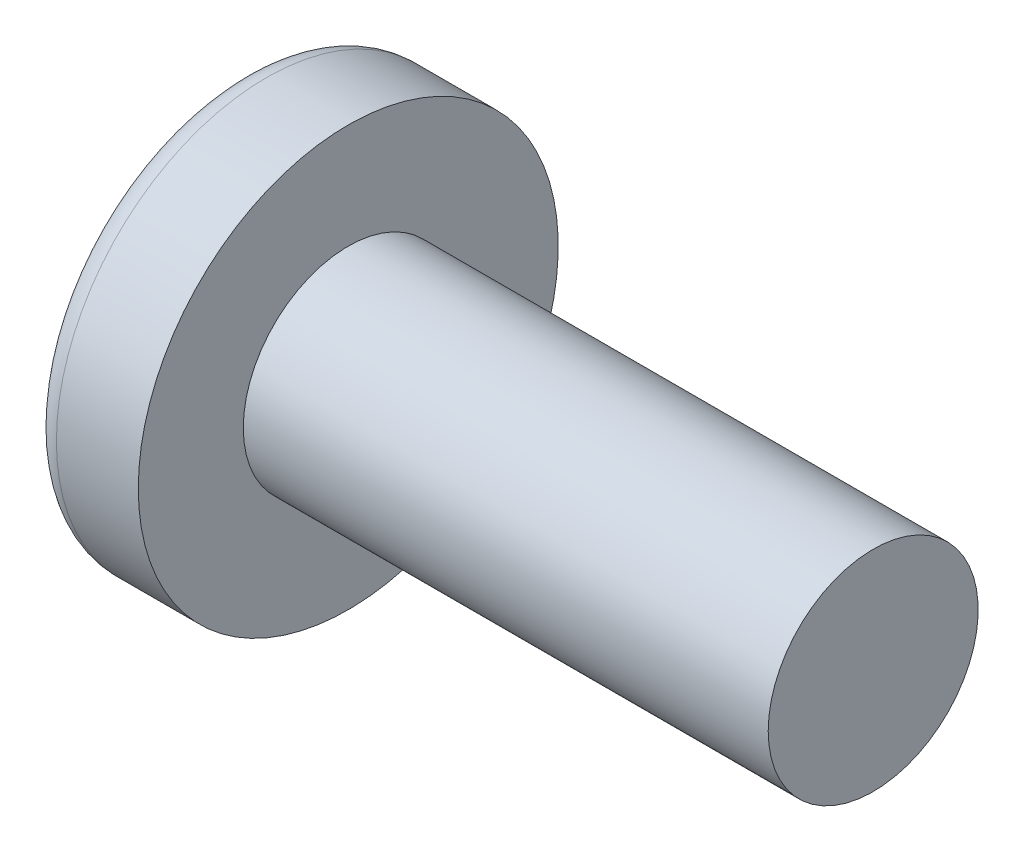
ISO-10303-21;
HEADER;
FILE_DESCRIPTION(('STEP AP214'),'2;1');
FILE_NAME('part.step','',(''),(''),'','','');
FILE_SCHEMA(('AUTOMOTIVE_DESIGN { 1 0 10303 214 1 1 1 1 }'));
ENDSEC;
DATA;
#1=APPLICATION_CONTEXT('core data for automotive mechanical design processes');
#2=APPLICATION_PROTOCOL_DEFINITION('international standard','automotive_design',2000,#1);
#3=PRODUCT_CONTEXT('',#1,'mechanical');
#4=PRODUCT('Part','Part','',(#3));
#5=PRODUCT_RELATED_PRODUCT_CATEGORY('part','',(#4));
#6=PRODUCT_DEFINITION_FORMATION('','',#4);
#7=PRODUCT_DEFINITION_CONTEXT('part definition',#1,'design');
#8=PRODUCT_DEFINITION('design','',#6,#7);
#9=PRODUCT_DEFINITION_SHAPE('','',#8);
#10=(LENGTH_UNIT() NAMED_UNIT(*) SI_UNIT(.MILLI.,.METRE.));
#11=(NAMED_UNIT(*) PLANE_ANGLE_UNIT() SI_UNIT($,.RADIAN.));
#12=(NAMED_UNIT(*) SI_UNIT($,.STERADIAN.) SOLID_ANGLE_UNIT());
#13=UNCERTAINTY_MEASURE_WITH_UNIT(LENGTH_MEASURE(1.E-05),#10,'distance_accuracy_value','');
#14=(GEOMETRIC_REPRESENTATION_CONTEXT(3) GLOBAL_UNCERTAINTY_ASSIGNED_CONTEXT((#13)) GLOBAL_UNIT_ASSIGNED_CONTEXT((#10,
#11,#12)) REPRESENTATION_CONTEXT('',''));
#15=CARTESIAN_POINT('',(0.,0.,0.));
#16=DIRECTION('',(0.,0.,1.));
#17=DIRECTION('',(1.,0.,0.));
#18=AXIS2_PLACEMENT_3D('',#15,#16,#17);
#19=CARTESIAN_POINT('',(3.2,0.,0.));
#20=DIRECTION('',(-1.,0.,0.));
#21=DIRECTION('',(0.,1.,0.));
#22=AXIS2_PLACEMENT_3D('',#19,#20,#21);
#23=SPHERICAL_SURFACE('',#22,3.2);
#24=CARTESIAN_POINT('',(0.627117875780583,0.,0.));
#25=DIRECTION('',(-1.,0.,0.));
#26=DIRECTION('',(0.,0.,1.));
#27=AXIS2_PLACEMENT_3D('',#24,#25,#26);
#28=CIRCLE('',#27,1.9027027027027);
#29=CARTESIAN_POINT('',(0.627117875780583,0.,1.9027027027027));
#30=VERTEX_POINT('',#29);
#31=EDGE_CURVE('E177',#30,#30,#28,.T.);
#32=ORIENTED_EDGE('',*,*,#31,.T.);
#33=EDGE_LOOP('',(#32));
#34=FACE_BOUND('',#33,.T.);
#35=CARTESIAN_POINT('',(3.19174554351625,-0.0818566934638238,0.));
#36=DIRECTION('',(-0.100331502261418,-0.994954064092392,0.));
#37=DIRECTION('',(0.994954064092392,-0.100331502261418,0.));
#38=AXIS2_PLACEMENT_3D('',#35,#36,#37);
#39=CIRCLE('',#38,3.1989422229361);
#40=CARTESIAN_POINT('',(0.118330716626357,0.228067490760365,0.83144431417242));
#41=VERTEX_POINT('',#40);
#42=CARTESIAN_POINT('',(0.0177814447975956,0.238206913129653,0.238206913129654));
#43=VERTEX_POINT('',#42);
#44=EDGE_CURVE('E228',#41,#43,#39,.T.);
#45=ORIENTED_EDGE('',*,*,#44,.F.);
#46=CARTESIAN_POINT('',(2.64043280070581,0.,-0.842892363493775));
#47=DIRECTION('',(0.553083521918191,0.,0.833125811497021));
#48=DIRECTION('',(0.833125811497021,0.,-0.553083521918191));
#49=AXIS2_PLACEMENT_3D('',#46,#47,#48);
#50=CIRCLE('',#49,3.03585523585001);
#51=CARTESIAN_POINT('',(0.118330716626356,-0.22806749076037,0.831444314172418));
#52=VERTEX_POINT('',#51);
#53=EDGE_CURVE('E176',#41,#52,#50,.T.);
#54=ORIENTED_EDGE('',*,*,#53,.T.);
#55=CARTESIAN_POINT('',(3.19174554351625,0.0818566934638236,0.));
#56=DIRECTION('',(-0.100331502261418,0.994954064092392,0.));
#57=DIRECTION('',(-0.994954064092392,-0.100331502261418,0.));
#58=AXIS2_PLACEMENT_3D('',#55,#56,#57);
#59=CIRCLE('',#58,3.1989422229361);
#60=CARTESIAN_POINT('',(0.0177814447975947,-0.238206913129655,0.238206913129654));
#61=VERTEX_POINT('',#60);
#62=EDGE_CURVE('E123',#61,#52,#59,.T.);
#63=ORIENTED_EDGE('',*,*,#62,.F.);
#64=CARTESIAN_POINT('',(3.19174554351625,0.,-0.0818566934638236));
#65=DIRECTION('',(-0.100331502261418,0.,-0.994954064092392));
#66=DIRECTION('',(-0.994954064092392,0.,0.100331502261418));
#67=AXIS2_PLACEMENT_3D('',#64,#65,#66);
#68=CIRCLE('',#67,3.1989422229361);
#69=CARTESIAN_POINT('',(0.118330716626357,-0.831444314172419,0.228067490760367));
#70=VERTEX_POINT('',#69);
#71=EDGE_CURVE('E150',#70,#61,#68,.T.);
#72=ORIENTED_EDGE('',*,*,#71,.F.);
#73=CARTESIAN_POINT('',(2.64043280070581,0.842892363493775,0.));
#74=DIRECTION('',(0.553083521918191,-0.833125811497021,0.));
#75=DIRECTION('',(0.833125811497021,0.553083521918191,0.));
#76=AXIS2_PLACEMENT_3D('',#73,#74,#75);
#77=CIRCLE('',#76,3.03585523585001);
#78=CARTESIAN_POINT('',(0.118330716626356,-0.831444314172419,-0.228067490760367));
#79=VERTEX_POINT('',#78);
#80=EDGE_CURVE('E159',#70,#79,#77,.T.);
#81=ORIENTED_EDGE('',*,*,#80,.T.);
#82=CARTESIAN_POINT('',(3.19174554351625,0.,0.0818566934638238));
#83=DIRECTION('',(-0.100331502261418,0.,0.994954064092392));
#84=DIRECTION('',(0.994954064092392,0.,0.100331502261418));
#85=AXIS2_PLACEMENT_3D('',#82,#83,#84);
#86=CIRCLE('',#85,3.1989422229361);
#87=CARTESIAN_POINT('',(0.0177814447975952,-0.238206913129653,-0.238206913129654));
#88=VERTEX_POINT('',#87);
#89=EDGE_CURVE('E66',#88,#79,#86,.T.);
#90=ORIENTED_EDGE('',*,*,#89,.F.);
#91=CARTESIAN_POINT('',(0.118330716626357,-0.228067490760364,-0.83144431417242));
#92=VERTEX_POINT('',#91);
#93=EDGE_CURVE('E229',#92,#88,#59,.T.);
#94=ORIENTED_EDGE('',*,*,#93,.F.);
#95=CARTESIAN_POINT('',(2.64043280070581,0.,0.842892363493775));
#96=DIRECTION('',(0.553083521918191,0.,-0.833125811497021));
#97=DIRECTION('',(-0.833125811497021,0.,-0.553083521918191));
#98=AXIS2_PLACEMENT_3D('',#95,#96,#97);
#99=CIRCLE('',#98,3.03585523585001);
#100=CARTESIAN_POINT('',(0.118330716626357,0.22806749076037,-0.831444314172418));
#101=VERTEX_POINT('',#100);
#102=EDGE_CURVE('E152',#92,#101,#99,.T.);
#103=ORIENTED_EDGE('',*,*,#102,.T.);
#104=CARTESIAN_POINT('',(0.0177814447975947,0.238206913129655,-0.238206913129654));
#105=VERTEX_POINT('',#104);
#106=EDGE_CURVE('E214',#105,#101,#39,.T.);
#107=ORIENTED_EDGE('',*,*,#106,.F.);
#108=CARTESIAN_POINT('',(0.118330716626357,0.831444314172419,-0.228067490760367));
#109=VERTEX_POINT('',#108);
#110=EDGE_CURVE('E59',#109,#105,#86,.T.);
#111=ORIENTED_EDGE('',*,*,#110,.F.);
#112=CARTESIAN_POINT('',(2.64043280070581,-0.842892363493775,0.));
#113=DIRECTION('',(0.553083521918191,0.833125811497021,0.));
#114=DIRECTION('',(-0.833125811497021,0.553083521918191,0.));
#115=AXIS2_PLACEMENT_3D('',#112,#113,#114);
#116=CIRCLE('',#115,3.03585523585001);
#117=CARTESIAN_POINT('',(0.118330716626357,0.831444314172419,0.228067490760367));
#118=VERTEX_POINT('',#117);
#119=EDGE_CURVE('E12',#109,#118,#116,.T.);
#120=ORIENTED_EDGE('',*,*,#119,.T.);
#121=EDGE_CURVE('E195',#43,#118,#68,.T.);
#122=ORIENTED_EDGE('',*,*,#121,.F.);
#123=EDGE_LOOP('',(#45,#54,#63,#72,#81,#90,#94,#103,#107,#111,#120,#122));
#124=FACE_BOUND('',#123,.T.);
#125=ADVANCED_FACE('F49',(#34,#124),#23,.T.);
#126=CARTESIAN_POINT('',(1.37075949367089,0.,-0.101772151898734));
#127=DIRECTION('',(-0.100331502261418,0.,0.994954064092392));
#128=DIRECTION('',(0.994954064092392,0.,0.100331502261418));
#129=AXIS2_PLACEMENT_3D('',#126,#127,#128);
#130=PLANE('',#129);
#131=ORIENTED_EDGE('',*,*,#110,.T.);
#132=DIRECTION('',(0.989983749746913,-0.0998302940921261,0.0998302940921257));
#133=VECTOR('',#132,1.);
#134=CARTESIAN_POINT('',(1.38081767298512,0.100757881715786,-0.100757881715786));
#135=LINE('',#134,#133);
#136=CARTESIAN_POINT('',(1.19,0.12,-0.12));
#137=VERTEX_POINT('',#136);
#138=EDGE_CURVE('E259',#105,#137,#135,.T.);
#139=ORIENTED_EDGE('',*,*,#138,.T.);
#140=DIRECTION('',(0.830201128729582,-0.551141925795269,0.083717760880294));
#141=VECTOR('',#140,1.);
#142=CARTESIAN_POINT('',(0.,0.91,-0.24));
#143=LINE('',#142,#141);
#144=EDGE_CURVE('E241',#109,#137,#143,.T.);
#145=ORIENTED_EDGE('',*,*,#144,.F.);
#146=EDGE_LOOP('',(#131,#139,#145));
#147=FACE_BOUND('',#146,.T.);
#148=ADVANCED_FACE('F305',(#147),#130,.T.);
#149=DIRECTION('',(0.830201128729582,0.551141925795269,0.083717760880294));
#150=VECTOR('',#149,1.);
#151=CARTESIAN_POINT('',(0.,-0.91,-0.24));
#152=LINE('',#151,#150);
#153=CARTESIAN_POINT('',(1.19,-0.12,-0.12));
#154=VERTEX_POINT('',#153);
#155=EDGE_CURVE('E161',#79,#154,#152,.T.);
#156=ORIENTED_EDGE('',*,*,#155,.T.);
#157=DIRECTION('',(-0.989983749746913,-0.0998302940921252,-0.0998302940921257));
#158=VECTOR('',#157,1.);
#159=CARTESIAN_POINT('',(1.38081767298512,-0.100757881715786,-0.100757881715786));
#160=LINE('',#159,#158);
#161=EDGE_CURVE('E264',#154,#88,#160,.T.);
#162=ORIENTED_EDGE('',*,*,#161,.T.);
#163=ORIENTED_EDGE('',*,*,#89,.T.);
#164=EDGE_LOOP('',(#156,#162,#163));
#165=FACE_BOUND('',#164,.T.);
#166=ADVANCED_FACE('F307',(#165),#130,.T.);
#167=CARTESIAN_POINT('',(1.37075949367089,0.,0.101772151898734));
#168=DIRECTION('',(-0.100331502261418,0.,-0.994954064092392));
#169=DIRECTION('',(-0.994954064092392,0.,0.100331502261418));
#170=AXIS2_PLACEMENT_3D('',#167,#168,#169);
#171=PLANE('',#170);
#172=DIRECTION('',(0.830201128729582,-0.551141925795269,-0.083717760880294));
#173=VECTOR('',#172,1.);
#174=CARTESIAN_POINT('',(0.,0.91,0.24));
#175=LINE('',#174,#173);
#176=CARTESIAN_POINT('',(1.19,0.12,0.12));
#177=VERTEX_POINT('',#176);
#178=EDGE_CURVE('E245',#118,#177,#175,.T.);
#179=ORIENTED_EDGE('',*,*,#178,.T.);
#180=DIRECTION('',(-0.989983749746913,0.0998302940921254,0.0998302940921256));
#181=VECTOR('',#180,1.);
#182=CARTESIAN_POINT('',(1.38081767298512,0.100757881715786,0.100757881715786));
#183=LINE('',#182,#181);
#184=EDGE_CURVE('E224',#177,#43,#183,.T.);
#185=ORIENTED_EDGE('',*,*,#184,.T.);
#186=ORIENTED_EDGE('',*,*,#121,.T.);
#187=EDGE_LOOP('',(#179,#185,#186));
#188=FACE_BOUND('',#187,.T.);
#189=ADVANCED_FACE('F292',(#188),#171,.T.);
#190=ORIENTED_EDGE('',*,*,#71,.T.);
#191=DIRECTION('',(0.989983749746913,0.099830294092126,-0.0998302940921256));
#192=VECTOR('',#191,1.);
#193=CARTESIAN_POINT('',(1.38081767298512,-0.100757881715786,0.100757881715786));
#194=LINE('',#193,#192);
#195=CARTESIAN_POINT('',(1.19,-0.12,0.12));
#196=VERTEX_POINT('',#195);
#197=EDGE_CURVE('E121',#61,#196,#194,.T.);
#198=ORIENTED_EDGE('',*,*,#197,.T.);
#199=DIRECTION('',(0.830201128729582,0.551141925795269,-0.0837177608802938));
#200=VECTOR('',#199,1.);
#201=CARTESIAN_POINT('',(0.,-0.91,0.24));
#202=LINE('',#201,#200);
#203=EDGE_CURVE('E148',#70,#196,#202,.T.);
#204=ORIENTED_EDGE('',*,*,#203,.F.);
#205=EDGE_LOOP('',(#190,#198,#204));
#206=FACE_BOUND('',#205,.T.);
#207=ADVANCED_FACE('F147',(#206),#171,.T.);
#208=CARTESIAN_POINT('',(-25.4,0.,0.));
#209=DIRECTION('',(-1.,0.,0.));
#210=DIRECTION('',(0.,0.,1.));
#211=AXIS2_PLACEMENT_3D('',#208,#209,#210);
#212=CYLINDRICAL_SURFACE('',#211,1.);
#213=CARTESIAN_POINT('',(6.6,0.,0.));
#214=DIRECTION('',(-1.,0.,0.));
#215=DIRECTION('',(0.,0.,1.));
#216=AXIS2_PLACEMENT_3D('',#213,#214,#215);
#217=CIRCLE('',#216,1.);
#218=CARTESIAN_POINT('',(6.6,0.,1.));
#219=VERTEX_POINT('',#218);
#220=EDGE_CURVE('E53',#219,#219,#217,.T.);
#221=ORIENTED_EDGE('',*,*,#220,.T.);
#222=EDGE_LOOP('',(#221));
#223=FACE_BOUND('',#222,.T.);
#224=CARTESIAN_POINT('',(1.6,0.,0.));
#225=DIRECTION('',(-1.,0.,0.));
#226=DIRECTION('',(0.,0.,1.));
#227=AXIS2_PLACEMENT_3D('',#224,#225,#226);
#228=CIRCLE('',#227,1.);
#229=CARTESIAN_POINT('',(1.6,0.,1.));
#230=VERTEX_POINT('',#229);
#231=EDGE_CURVE('E189',#230,#230,#228,.T.);
#232=ORIENTED_EDGE('',*,*,#231,.F.);
#233=EDGE_LOOP('',(#232));
#234=FACE_BOUND('',#233,.T.);
#235=ADVANCED_FACE('F334',(#223,#234),#212,.T.);
#236=CARTESIAN_POINT('',(1.6,1.,0.));
#237=DIRECTION('',(-1.,0.,0.));
#238=DIRECTION('',(0.,0.,1.));
#239=AXIS2_PLACEMENT_3D('',#236,#237,#238);
#240=PLANE('',#239);
#241=CARTESIAN_POINT('',(1.6,0.,0.));
#242=DIRECTION('',(-1.,0.,0.));
#243=DIRECTION('',(0.,0.,1.));
#244=AXIS2_PLACEMENT_3D('',#241,#242,#243);
#245=CIRCLE('',#244,2.);
#246=CARTESIAN_POINT('',(1.6,0.,2.));
#247=VERTEX_POINT('',#246);
#248=EDGE_CURVE('E185',#247,#247,#245,.T.);
#249=ORIENTED_EDGE('',*,*,#248,.F.);
#250=EDGE_LOOP('',(#249));
#251=FACE_BOUND('',#250,.T.);
#252=ORIENTED_EDGE('',*,*,#231,.T.);
#253=EDGE_LOOP('',(#252));
#254=FACE_BOUND('',#253,.T.);
#255=ADVANCED_FACE('F331',(#251,#254),#240,.F.);
#256=CARTESIAN_POINT('',(-25.4,0.,0.));
#257=DIRECTION('',(-1.,0.,0.));
#258=DIRECTION('',(0.,0.,1.));
#259=AXIS2_PLACEMENT_3D('',#256,#257,#258);
#260=CYLINDRICAL_SURFACE('',#259,2.);
#261=ORIENTED_EDGE('',*,*,#248,.T.);
#262=EDGE_LOOP('',(#261));
#263=FACE_BOUND('',#262,.T.);
#264=CARTESIAN_POINT('',(0.820084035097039,0.,0.));
#265=DIRECTION('',(-1.,0.,0.));
#266=DIRECTION('',(0.,0.,1.));
#267=AXIS2_PLACEMENT_3D('',#264,#265,#266);
#268=CIRCLE('',#267,2.);
#269=CARTESIAN_POINT('',(0.820084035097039,0.,2.));
#270=VERTEX_POINT('',#269);
#271=EDGE_CURVE('E181',#270,#270,#268,.T.);
#272=ORIENTED_EDGE('',*,*,#271,.F.);
#273=EDGE_LOOP('',(#272));
#274=FACE_BOUND('',#273,.T.);
#275=ADVANCED_FACE('F327',(#263,#274),#260,.T.);
#276=CARTESIAN_POINT('',(0.820084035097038,0.,0.));
#277=DIRECTION('',(-1.,0.,0.));
#278=DIRECTION('',(0.,0.,1.));
#279=AXIS2_PLACEMENT_3D('',#276,#277,#278);
#280=TOROIDAL_SURFACE('',#279,1.76,0.24);
#281=ORIENTED_EDGE('',*,*,#271,.T.);
#282=EDGE_LOOP('',(#281));
#283=FACE_BOUND('',#282,.T.);
#284=ORIENTED_EDGE('',*,*,#31,.F.);
#285=EDGE_LOOP('',(#284));
#286=FACE_BOUND('',#285,.T.);
#287=ADVANCED_FACE('F324',(#283,#286),#280,.T.);
#288=CARTESIAN_POINT('',(6.6,1.,0.));
#289=DIRECTION('',(1.,0.,0.));
#290=DIRECTION('',(0.,0.,-1.));
#291=AXIS2_PLACEMENT_3D('',#288,#289,#290);
#292=PLANE('',#291);
#293=ORIENTED_EDGE('',*,*,#220,.F.);
#294=EDGE_LOOP('',(#293));
#295=FACE_BOUND('',#294,.T.);
#296=ADVANCED_FACE('F51',(#295),#292,.T.);
#297=CARTESIAN_POINT('',(1.19,0.12,0.12));
#298=DIRECTION('',(0.553083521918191,0.833125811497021,0.));
#299=DIRECTION('',(-0.833125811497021,0.553083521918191,0.));
#300=AXIS2_PLACEMENT_3D('',#297,#298,#299);
#301=PLANE('',#300);
#302=ORIENTED_EDGE('',*,*,#144,.T.);
#303=DIRECTION('',(0.,0.,-1.));
#304=VECTOR('',#303,1.);
#305=CARTESIAN_POINT('',(1.19,0.12,0.12));
#306=LINE('',#305,#304);
#307=EDGE_CURVE('E141',#177,#137,#306,.T.);
#308=ORIENTED_EDGE('',*,*,#307,.F.);
#309=ORIENTED_EDGE('',*,*,#178,.F.);
#310=ORIENTED_EDGE('',*,*,#119,.F.);
#311=EDGE_LOOP('',(#302,#308,#309,#310));
#312=FACE_BOUND('',#311,.T.);
#313=ADVANCED_FACE('F295',(#312),#301,.F.);
#314=CARTESIAN_POINT('',(0.,-0.91,-0.24));
#315=DIRECTION('',(0.553083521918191,-0.833125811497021,0.));
#316=DIRECTION('',(0.833125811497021,0.553083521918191,0.));
#317=AXIS2_PLACEMENT_3D('',#314,#315,#316);
#318=PLANE('',#317);
#319=ORIENTED_EDGE('',*,*,#203,.T.);
#320=DIRECTION('',(0.,0.,1.));
#321=VECTOR('',#320,1.);
#322=CARTESIAN_POINT('',(1.19,-0.12,-0.12));
#323=LINE('',#322,#321);
#324=EDGE_CURVE('E140',#154,#196,#323,.T.);
#325=ORIENTED_EDGE('',*,*,#324,.F.);
#326=ORIENTED_EDGE('',*,*,#155,.F.);
#327=ORIENTED_EDGE('',*,*,#80,.F.);
#328=EDGE_LOOP('',(#319,#325,#326,#327));
#329=FACE_BOUND('',#328,.T.);
#330=ADVANCED_FACE('F156',(#329),#318,.F.);
#331=CARTESIAN_POINT('',(1.19,0.12,-0.12));
#332=DIRECTION('',(-1.,0.,0.));
#333=DIRECTION('',(0.,0.,1.));
#334=AXIS2_PLACEMENT_3D('',#331,#332,#333);
#335=PLANE('',#334);
#336=DIRECTION('',(0.,1.,0.));
#337=VECTOR('',#336,1.);
#338=CARTESIAN_POINT('',(1.19,-0.12,-0.12));
#339=LINE('',#338,#337);
#340=EDGE_CURVE('E165',#154,#137,#339,.T.);
#341=ORIENTED_EDGE('',*,*,#340,.F.);
#342=ORIENTED_EDGE('',*,*,#324,.T.);
#343=DIRECTION('',(0.,-1.,0.));
#344=VECTOR('',#343,1.);
#345=CARTESIAN_POINT('',(1.19,0.12,0.12));
#346=LINE('',#345,#344);
#347=EDGE_CURVE('E131',#177,#196,#346,.T.);
#348=ORIENTED_EDGE('',*,*,#347,.F.);
#349=ORIENTED_EDGE('',*,*,#307,.T.);
#350=EDGE_LOOP('',(#341,#342,#348,#349));
#351=FACE_BOUND('',#350,.T.);
#352=ADVANCED_FACE('F163',(#351),#335,.T.);
#353=CARTESIAN_POINT('',(0.,0.240000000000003,-0.909999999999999));
#354=DIRECTION('',(0.553083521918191,0.,-0.833125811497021));
#355=DIRECTION('',(0.833125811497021,0.,0.553083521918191));
#356=AXIS2_PLACEMENT_3D('',#353,#354,#355);
#357=PLANE('',#356);
#358=DIRECTION('',(0.830201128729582,0.0837177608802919,0.551141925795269));
#359=VECTOR('',#358,1.);
#360=CARTESIAN_POINT('',(0.,-0.239999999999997,-0.910000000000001));
#361=LINE('',#360,#359);
#362=EDGE_CURVE('E217',#92,#154,#361,.T.);
#363=ORIENTED_EDGE('',*,*,#362,.T.);
#364=ORIENTED_EDGE('',*,*,#340,.T.);
#365=DIRECTION('',(0.830201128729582,-0.0837177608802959,0.551141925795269));
#366=VECTOR('',#365,1.);
#367=CARTESIAN_POINT('',(0.,0.240000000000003,-0.909999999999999));
#368=LINE('',#367,#366);
#369=EDGE_CURVE('E128',#101,#137,#368,.T.);
#370=ORIENTED_EDGE('',*,*,#369,.F.);
#371=ORIENTED_EDGE('',*,*,#102,.F.);
#372=EDGE_LOOP('',(#363,#364,#370,#371));
#373=FACE_BOUND('',#372,.T.);
#374=ADVANCED_FACE('F302',(#373),#357,.F.);
#375=CARTESIAN_POINT('',(1.37075949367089,-0.101772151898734,0.));
#376=DIRECTION('',(-0.100331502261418,0.994954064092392,0.));
#377=DIRECTION('',(-0.994954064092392,-0.100331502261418,0.));
#378=AXIS2_PLACEMENT_3D('',#375,#376,#377);
#379=PLANE('',#378);
#380=ORIENTED_EDGE('',*,*,#93,.T.);
#381=ORIENTED_EDGE('',*,*,#161,.F.);
#382=ORIENTED_EDGE('',*,*,#362,.F.);
#383=EDGE_LOOP('',(#380,#381,#382));
#384=FACE_BOUND('',#383,.T.);
#385=ADVANCED_FACE('F386',(#384),#379,.T.);
#386=CARTESIAN_POINT('',(1.37075949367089,0.101772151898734,0.));
#387=DIRECTION('',(-0.100331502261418,-0.994954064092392,0.));
#388=DIRECTION('',(0.994954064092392,-0.100331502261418,0.));
#389=AXIS2_PLACEMENT_3D('',#386,#387,#388);
#390=PLANE('',#389);
#391=ORIENTED_EDGE('',*,*,#106,.T.);
#392=ORIENTED_EDGE('',*,*,#369,.T.);
#393=ORIENTED_EDGE('',*,*,#138,.F.);
#394=EDGE_LOOP('',(#391,#392,#393));
#395=FACE_BOUND('',#394,.T.);
#396=ADVANCED_FACE('F300',(#395),#390,.T.);
#397=CARTESIAN_POINT('',(1.19,-0.12,0.12));
#398=DIRECTION('',(0.553083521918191,0.,0.833125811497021));
#399=DIRECTION('',(-0.833125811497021,0.,0.553083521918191));
#400=AXIS2_PLACEMENT_3D('',#397,#398,#399);
#401=PLANE('',#400);
#402=DIRECTION('',(0.830201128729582,-0.0837177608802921,-0.551141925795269));
#403=VECTOR('',#402,1.);
#404=CARTESIAN_POINT('',(0.,0.239999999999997,0.910000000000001));
#405=LINE('',#404,#403);
#406=EDGE_CURVE('E127',#41,#177,#405,.T.);
#407=ORIENTED_EDGE('',*,*,#406,.T.);
#408=ORIENTED_EDGE('',*,*,#347,.T.);
#409=DIRECTION('',(0.830201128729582,0.0837177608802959,-0.551141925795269));
#410=VECTOR('',#409,1.);
#411=CARTESIAN_POINT('',(0.,-0.240000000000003,0.909999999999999));
#412=LINE('',#411,#410);
#413=EDGE_CURVE('E117',#52,#196,#412,.T.);
#414=ORIENTED_EDGE('',*,*,#413,.F.);
#415=ORIENTED_EDGE('',*,*,#53,.F.);
#416=EDGE_LOOP('',(#407,#408,#414,#415));
#417=FACE_BOUND('',#416,.T.);
#418=ADVANCED_FACE('F132',(#417),#401,.F.);
#419=ORIENTED_EDGE('',*,*,#44,.T.);
#420=ORIENTED_EDGE('',*,*,#184,.F.);
#421=ORIENTED_EDGE('',*,*,#406,.F.);
#422=EDGE_LOOP('',(#419,#420,#421));
#423=FACE_BOUND('',#422,.T.);
#424=ADVANCED_FACE('F400',(#423),#390,.T.);
#425=ORIENTED_EDGE('',*,*,#62,.T.);
#426=ORIENTED_EDGE('',*,*,#413,.T.);
#427=ORIENTED_EDGE('',*,*,#197,.F.);
#428=EDGE_LOOP('',(#425,#426,#427));
#429=FACE_BOUND('',#428,.T.);
#430=ADVANCED_FACE('F119',(#429),#379,.T.);
#431=CLOSED_SHELL('',(#125,#148,#166,#189,#207,#235,#255,#275,#287,#296,#313,#330,#352,#374,
#385,#396,#418,#424,#430));
#432=MANIFOLD_SOLID_BREP('B2',#431);
#433=ADVANCED_BREP_SHAPE_REPRESENTATION('',(#18,#432),#14);
#434=SHAPE_DEFINITION_REPRESENTATION(#9,#433);
ENDSEC;
END-ISO-10303-21;
